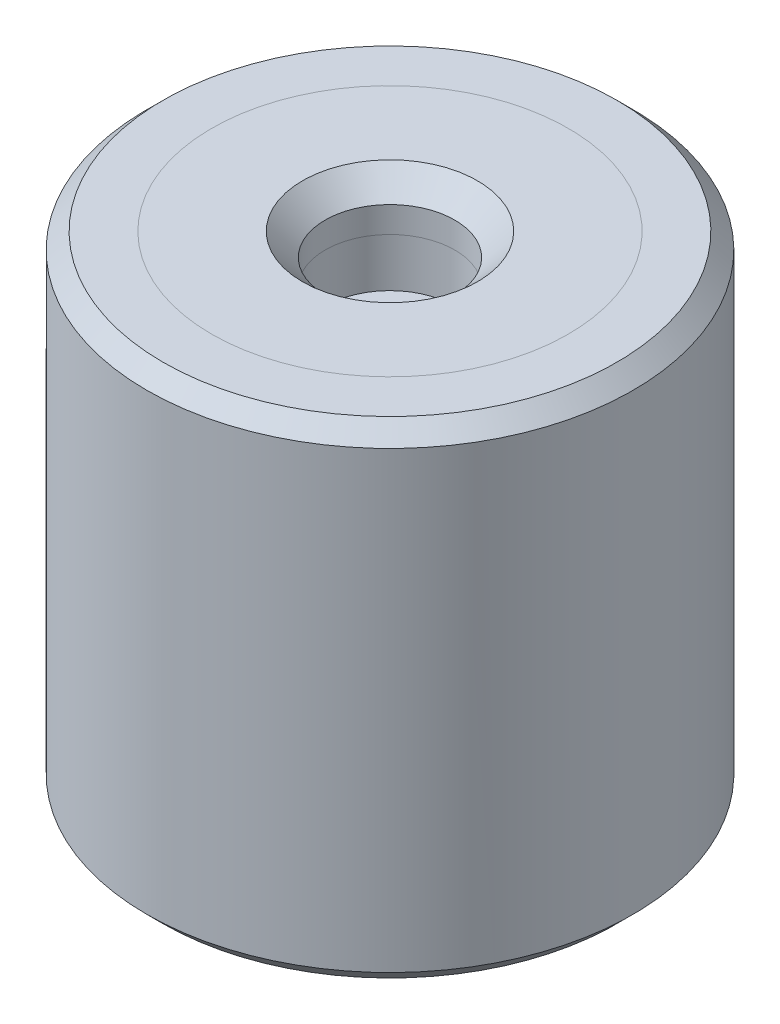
ISO-10303-21;
HEADER;
FILE_DESCRIPTION(('STEP AP214'),'2;1');
FILE_NAME('part.step','',(''),(''),'','','');
FILE_SCHEMA(('AUTOMOTIVE_DESIGN { 1 0 10303 214 1 1 1 1 }'));
ENDSEC;
DATA;
#1=APPLICATION_CONTEXT('core data for automotive mechanical design processes');
#2=APPLICATION_PROTOCOL_DEFINITION('international standard','automotive_design',2000,#1);
#3=PRODUCT_CONTEXT('',#1,'mechanical');
#4=PRODUCT('Part','Part','',(#3));
#5=PRODUCT_RELATED_PRODUCT_CATEGORY('part','',(#4));
#6=PRODUCT_DEFINITION_FORMATION('','',#4);
#7=PRODUCT_DEFINITION_CONTEXT('part definition',#1,'design');
#8=PRODUCT_DEFINITION('design','',#6,#7);
#9=PRODUCT_DEFINITION_SHAPE('','',#8);
#10=(LENGTH_UNIT() NAMED_UNIT(*) SI_UNIT(.MILLI.,.METRE.));
#11=(NAMED_UNIT(*) PLANE_ANGLE_UNIT() SI_UNIT($,.RADIAN.));
#12=(NAMED_UNIT(*) SI_UNIT($,.STERADIAN.) SOLID_ANGLE_UNIT());
#13=UNCERTAINTY_MEASURE_WITH_UNIT(LENGTH_MEASURE(1.E-05),#10,'distance_accuracy_value','');
#14=(GEOMETRIC_REPRESENTATION_CONTEXT(3) GLOBAL_UNCERTAINTY_ASSIGNED_CONTEXT((#13)) GLOBAL_UNIT_ASSIGNED_CONTEXT((#10,
#11,#12)) REPRESENTATION_CONTEXT('',''));
#15=CARTESIAN_POINT('',(0.,0.,0.));
#16=DIRECTION('',(0.,0.,1.));
#17=DIRECTION('',(1.,0.,0.));
#18=AXIS2_PLACEMENT_3D('',#15,#16,#17);
#19=CARTESIAN_POINT('',(0.,56.0340428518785,0.));
#20=DIRECTION('',(0.,1.,0.));
#21=DIRECTION('',(0.,0.,1.));
#22=AXIS2_PLACEMENT_3D('',#19,#20,#21);
#23=CYLINDRICAL_SURFACE('',#22,2.);
#24=CARTESIAN_POINT('',(0.,-12.8,0.));
#25=DIRECTION('',(0.,-1.,0.));
#26=DIRECTION('',(0.,0.,-1.));
#27=AXIS2_PLACEMENT_3D('',#24,#25,#26);
#28=CIRCLE('',#27,2.);
#29=CARTESIAN_POINT('',(0.,-12.8,-2.));
#30=VERTEX_POINT('',#29);
#31=EDGE_CURVE('P0_E10',#30,#30,#28,.T.);
#32=ORIENTED_EDGE('',*,*,#31,.T.);
#33=EDGE_LOOP('',(#32));
#34=FACE_BOUND('',#33,.T.);
#35=CARTESIAN_POINT('',(0.,-12.,0.));
#36=DIRECTION('',(0.,1.,0.));
#37=DIRECTION('',(0.,0.,1.));
#38=AXIS2_PLACEMENT_3D('',#35,#36,#37);
#39=CIRCLE('',#38,2.);
#40=CARTESIAN_POINT('',(0.,-12.,2.));
#41=VERTEX_POINT('',#40);
#42=EDGE_CURVE('P0_E25',#41,#41,#39,.T.);
#43=ORIENTED_EDGE('',*,*,#42,.T.);
#44=EDGE_LOOP('',(#43));
#45=FACE_BOUND('',#44,.T.);
#46=ADVANCED_FACE('P0_F14',(#34,#45),#23,.F.);
#47=CARTESIAN_POINT('',(0.,-12.,2.));
#48=DIRECTION('',(0.,1.,0.));
#49=DIRECTION('',(0.,0.,1.));
#50=AXIS2_PLACEMENT_3D('',#47,#48,#49);
#51=PLANE('',#50);
#52=CARTESIAN_POINT('',(0.,-12.,0.));
#53=DIRECTION('',(0.,1.,0.));
#54=DIRECTION('',(0.,0.,1.));
#55=AXIS2_PLACEMENT_3D('',#52,#53,#54);
#56=CIRCLE('',#55,5.5);
#57=CARTESIAN_POINT('',(0.,-12.,5.5));
#58=VERTEX_POINT('',#57);
#59=EDGE_CURVE('P0_E29',#58,#58,#56,.T.);
#60=ORIENTED_EDGE('',*,*,#59,.T.);
#61=EDGE_LOOP('',(#60));
#62=FACE_BOUND('',#61,.T.);
#63=ORIENTED_EDGE('',*,*,#42,.F.);
#64=EDGE_LOOP('',(#63));
#65=FACE_BOUND('',#64,.T.);
#66=ADVANCED_FACE('P0_F50',(#62,#65),#51,.T.);
#67=CARTESIAN_POINT('',(0.,56.0340428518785,0.));
#68=DIRECTION('',(0.,1.,0.));
#69=DIRECTION('',(0.,0.,1.));
#70=AXIS2_PLACEMENT_3D('',#67,#68,#69);
#71=CYLINDRICAL_SURFACE('',#70,5.5);
#72=CARTESIAN_POINT('',(0.,-13.5,0.));
#73=DIRECTION('',(0.,1.,0.));
#74=DIRECTION('',(0.,0.,1.));
#75=AXIS2_PLACEMENT_3D('',#72,#73,#74);
#76=CIRCLE('',#75,5.5);
#77=CARTESIAN_POINT('',(0.,-13.5,5.5));
#78=VERTEX_POINT('',#77);
#79=EDGE_CURVE('P0_E34',#78,#78,#76,.T.);
#80=ORIENTED_EDGE('',*,*,#79,.T.);
#81=EDGE_LOOP('',(#80));
#82=FACE_BOUND('',#81,.T.);
#83=ORIENTED_EDGE('',*,*,#59,.F.);
#84=EDGE_LOOP('',(#83));
#85=FACE_BOUND('',#84,.T.);
#86=ADVANCED_FACE('P0_F38',(#82,#85),#71,.T.);
#87=CARTESIAN_POINT('',(0.,-13.5,5.5));
#88=DIRECTION('',(0.,-1.,0.));
#89=DIRECTION('',(0.,0.,-1.));
#90=AXIS2_PLACEMENT_3D('',#87,#88,#89);
#91=PLANE('',#90);
#92=CARTESIAN_POINT('',(0.,-13.5,0.));
#93=DIRECTION('',(0.,-1.,0.));
#94=DIRECTION('',(0.,0.,-1.));
#95=AXIS2_PLACEMENT_3D('',#92,#93,#94);
#96=CIRCLE('',#95,2.7);
#97=CARTESIAN_POINT('',(0.,-13.5,-2.7));
#98=VERTEX_POINT('',#97);
#99=EDGE_CURVE('P0_E21',#98,#98,#96,.F.);
#100=ORIENTED_EDGE('',*,*,#99,.T.);
#101=EDGE_LOOP('',(#100));
#102=FACE_BOUND('',#101,.T.);
#103=ORIENTED_EDGE('',*,*,#79,.F.);
#104=EDGE_LOOP('',(#103));
#105=FACE_BOUND('',#104,.T.);
#106=ADVANCED_FACE('P0_F41',(#102,#105),#91,.T.);
#107=CARTESIAN_POINT('',(0.,-13.5,0.));
#108=DIRECTION('',(0.,-1.,0.));
#109=DIRECTION('',(0.,0.,-1.));
#110=AXIS2_PLACEMENT_3D('',#107,#108,#109);
#111=CONICAL_SURFACE('',#110,2.7,0.785398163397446);
#112=ORIENTED_EDGE('',*,*,#31,.F.);
#113=EDGE_LOOP('',(#112));
#114=FACE_BOUND('',#113,.T.);
#115=ORIENTED_EDGE('',*,*,#99,.F.);
#116=EDGE_LOOP('',(#115));
#117=FACE_BOUND('',#116,.T.);
#118=ADVANCED_FACE('P0_F16',(#114,#117),#111,.F.);
#119=CLOSED_SHELL('',(#46,#66,#86,#106,#118));
#120=MANIFOLD_SOLID_BREP('P0_B1',#119);
#121=CARTESIAN_POINT('',(0.,69.5340428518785,0.));
#122=DIRECTION('',(0.,1.,0.));
#123=DIRECTION('',(0.,0.,1.));
#124=AXIS2_PLACEMENT_3D('',#121,#122,#123);
#125=CYLINDRICAL_SURFACE('',#124,2.);
#126=CARTESIAN_POINT('',(0.,0.800000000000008,0.));
#127=DIRECTION('',(0.,1.,0.));
#128=DIRECTION('',(0.,0.,1.));
#129=AXIS2_PLACEMENT_3D('',#126,#127,#128);
#130=CIRCLE('',#129,2.);
#131=CARTESIAN_POINT('',(0.,0.800000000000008,2.));
#132=VERTEX_POINT('',#131);
#133=EDGE_CURVE('P1_E21',#132,#132,#130,.T.);
#134=ORIENTED_EDGE('',*,*,#133,.T.);
#135=EDGE_LOOP('',(#134));
#136=FACE_BOUND('',#135,.T.);
#137=CARTESIAN_POINT('',(0.,0.,0.));
#138=DIRECTION('',(0.,1.,0.));
#139=DIRECTION('',(0.,0.,1.));
#140=AXIS2_PLACEMENT_3D('',#137,#138,#139);
#141=CIRCLE('',#140,2.);
#142=CARTESIAN_POINT('',(0.,0.,2.));
#143=VERTEX_POINT('',#142);
#144=EDGE_CURVE('P1_E34',#143,#143,#141,.T.);
#145=ORIENTED_EDGE('',*,*,#144,.F.);
#146=EDGE_LOOP('',(#145));
#147=FACE_BOUND('',#146,.T.);
#148=ADVANCED_FACE('P1_F14',(#136,#147),#125,.F.);
#149=CARTESIAN_POINT('',(0.,1.5,2.));
#150=DIRECTION('',(0.,1.,0.));
#151=DIRECTION('',(0.,0.,1.));
#152=AXIS2_PLACEMENT_3D('',#149,#150,#151);
#153=PLANE('',#152);
#154=CARTESIAN_POINT('',(0.,1.5,0.));
#155=DIRECTION('',(0.,1.,0.));
#156=DIRECTION('',(0.,0.,1.));
#157=AXIS2_PLACEMENT_3D('',#154,#155,#156);
#158=CIRCLE('',#157,2.7);
#159=CARTESIAN_POINT('',(0.,1.5,2.7));
#160=VERTEX_POINT('',#159);
#161=EDGE_CURVE('P1_E10',#160,#160,#158,.F.);
#162=ORIENTED_EDGE('',*,*,#161,.T.);
#163=EDGE_LOOP('',(#162));
#164=FACE_BOUND('',#163,.T.);
#165=CARTESIAN_POINT('',(0.,1.5,0.));
#166=DIRECTION('',(0.,1.,0.));
#167=DIRECTION('',(0.,0.,1.));
#168=AXIS2_PLACEMENT_3D('',#165,#166,#167);
#169=CIRCLE('',#168,5.5);
#170=CARTESIAN_POINT('',(0.,1.5,5.5));
#171=VERTEX_POINT('',#170);
#172=EDGE_CURVE('P1_E25',#171,#171,#169,.T.);
#173=ORIENTED_EDGE('',*,*,#172,.T.);
#174=EDGE_LOOP('',(#173));
#175=FACE_BOUND('',#174,.T.);
#176=ADVANCED_FACE('P1_F42',(#164,#175),#153,.T.);
#177=CARTESIAN_POINT('',(0.,69.5340428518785,0.));
#178=DIRECTION('',(0.,1.,0.));
#179=DIRECTION('',(0.,0.,1.));
#180=AXIS2_PLACEMENT_3D('',#177,#178,#179);
#181=CYLINDRICAL_SURFACE('',#180,5.5);
#182=CARTESIAN_POINT('',(0.,0.,0.));
#183=DIRECTION('',(0.,1.,0.));
#184=DIRECTION('',(0.,0.,1.));
#185=AXIS2_PLACEMENT_3D('',#182,#183,#184);
#186=CIRCLE('',#185,5.5);
#187=CARTESIAN_POINT('',(0.,0.,5.5));
#188=VERTEX_POINT('',#187);
#189=EDGE_CURVE('P1_E29',#188,#188,#186,.T.);
#190=ORIENTED_EDGE('',*,*,#189,.T.);
#191=EDGE_LOOP('',(#190));
#192=FACE_BOUND('',#191,.T.);
#193=ORIENTED_EDGE('',*,*,#172,.F.);
#194=EDGE_LOOP('',(#193));
#195=FACE_BOUND('',#194,.T.);
#196=ADVANCED_FACE('P1_F47',(#192,#195),#181,.T.);
#197=CARTESIAN_POINT('',(0.,0.,5.5));
#198=DIRECTION('',(0.,-1.,0.));
#199=DIRECTION('',(0.,0.,-1.));
#200=AXIS2_PLACEMENT_3D('',#197,#198,#199);
#201=PLANE('',#200);
#202=ORIENTED_EDGE('',*,*,#144,.T.);
#203=EDGE_LOOP('',(#202));
#204=FACE_BOUND('',#203,.T.);
#205=ORIENTED_EDGE('',*,*,#189,.F.);
#206=EDGE_LOOP('',(#205));
#207=FACE_BOUND('',#206,.T.);
#208=ADVANCED_FACE('P1_F38',(#204,#207),#201,.T.);
#209=CARTESIAN_POINT('',(0.,0.800000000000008,0.));
#210=DIRECTION('',(0.,1.,0.));
#211=DIRECTION('',(0.,0.,1.));
#212=AXIS2_PLACEMENT_3D('',#209,#210,#211);
#213=CONICAL_SURFACE('',#212,2.,0.785398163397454);
#214=ORIENTED_EDGE('',*,*,#161,.F.);
#215=EDGE_LOOP('',(#214));
#216=FACE_BOUND('',#215,.T.);
#217=ORIENTED_EDGE('',*,*,#133,.F.);
#218=EDGE_LOOP('',(#217));
#219=FACE_BOUND('',#218,.T.);
#220=ADVANCED_FACE('P1_F16',(#216,#219),#213,.F.);
#221=CLOSED_SHELL('',(#148,#176,#196,#208,#220));
#222=MANIFOLD_SOLID_BREP('P1_B1',#221);
#223=CARTESIAN_POINT('',(0.,0.,0.));
#224=DIRECTION('',(0.,1.,0.));
#225=DIRECTION('',(0.,0.,1.));
#226=AXIS2_PLACEMENT_3D('',#223,#224,#225);
#227=PLANE('',#226);
#228=CARTESIAN_POINT('',(0.,0.,0.));
#229=DIRECTION('',(0.,1.,0.));
#230=DIRECTION('',(0.,0.,1.));
#231=AXIS2_PLACEMENT_3D('',#228,#229,#230);
#232=CIRCLE('',#231,2.);
#233=CARTESIAN_POINT('',(0.,0.,2.));
#234=VERTEX_POINT('',#233);
#235=EDGE_CURVE('P2_E46',#234,#234,#232,.T.);
#236=ORIENTED_EDGE('',*,*,#235,.F.);
#237=EDGE_LOOP('',(#236));
#238=FACE_BOUND('',#237,.T.);
#239=CARTESIAN_POINT('',(0.,0.,0.));
#240=DIRECTION('',(0.,1.,0.));
#241=DIRECTION('',(0.,0.,1.));
#242=AXIS2_PLACEMENT_3D('',#239,#240,#241);
#243=CIRCLE('',#242,5.5);
#244=CARTESIAN_POINT('',(0.,0.,5.5));
#245=VERTEX_POINT('',#244);
#246=EDGE_CURVE('P2_E33',#245,#245,#243,.T.);
#247=ORIENTED_EDGE('',*,*,#246,.T.);
#248=EDGE_LOOP('',(#247));
#249=FACE_BOUND('',#248,.T.);
#250=ADVANCED_FACE('P2_F13',(#238,#249),#227,.T.);
#251=CARTESIAN_POINT('',(0.,65.5134936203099,0.));
#252=DIRECTION('',(0.,1.,0.));
#253=DIRECTION('',(0.,0.,1.));
#254=AXIS2_PLACEMENT_3D('',#251,#252,#253);
#255=CYLINDRICAL_SURFACE('',#254,5.5);
#256=CARTESIAN_POINT('',(0.,1.5,0.));
#257=DIRECTION('',(0.,1.,0.));
#258=DIRECTION('',(0.,0.,1.));
#259=AXIS2_PLACEMENT_3D('',#256,#257,#258);
#260=CIRCLE('',#259,5.5);
#261=CARTESIAN_POINT('',(0.,1.5,5.5));
#262=VERTEX_POINT('',#261);
#263=EDGE_CURVE('P2_E36',#262,#262,#260,.T.);
#264=ORIENTED_EDGE('',*,*,#263,.T.);
#265=EDGE_LOOP('',(#264));
#266=FACE_BOUND('',#265,.T.);
#267=ORIENTED_EDGE('',*,*,#246,.F.);
#268=EDGE_LOOP('',(#267));
#269=FACE_BOUND('',#268,.T.);
#270=ADVANCED_FACE('P2_F92',(#266,#269),#255,.F.);
#271=CARTESIAN_POINT('',(0.,1.5,5.5));
#272=DIRECTION('',(0.,1.,0.));
#273=DIRECTION('',(0.,0.,1.));
#274=AXIS2_PLACEMENT_3D('',#271,#272,#273);
#275=PLANE('',#274);
#276=CARTESIAN_POINT('',(0.,1.5,0.));
#277=DIRECTION('',(0.,1.,0.));
#278=DIRECTION('',(0.,0.,1.));
#279=AXIS2_PLACEMENT_3D('',#276,#277,#278);
#280=CIRCLE('',#279,7.);
#281=CARTESIAN_POINT('',(0.,1.5,7.));
#282=VERTEX_POINT('',#281);
#283=EDGE_CURVE('P2_E9',#282,#282,#280,.T.);
#284=ORIENTED_EDGE('',*,*,#283,.T.);
#285=EDGE_LOOP('',(#284));
#286=FACE_BOUND('',#285,.T.);
#287=ORIENTED_EDGE('',*,*,#263,.F.);
#288=EDGE_LOOP('',(#287));
#289=FACE_BOUND('',#288,.T.);
#290=ADVANCED_FACE('P2_F88',(#286,#289),#275,.T.);
#291=CARTESIAN_POINT('',(0.,65.5134936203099,0.));
#292=DIRECTION('',(0.,1.,0.));
#293=DIRECTION('',(0.,0.,1.));
#294=AXIS2_PLACEMENT_3D('',#291,#292,#293);
#295=CYLINDRICAL_SURFACE('',#294,7.5);
#296=CARTESIAN_POINT('',(0.,-13.,0.));
#297=DIRECTION('',(0.,-1.,0.));
#298=DIRECTION('',(0.,0.,-1.));
#299=AXIS2_PLACEMENT_3D('',#296,#297,#298);
#300=CIRCLE('',#299,7.5);
#301=CARTESIAN_POINT('',(0.,-13.,-7.5));
#302=VERTEX_POINT('',#301);
#303=EDGE_CURVE('P2_E24',#302,#302,#300,.F.);
#304=ORIENTED_EDGE('',*,*,#303,.T.);
#305=EDGE_LOOP('',(#304));
#306=FACE_BOUND('',#305,.T.);
#307=CARTESIAN_POINT('',(0.,0.999999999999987,0.));
#308=DIRECTION('',(0.,1.,0.));
#309=DIRECTION('',(0.,0.,1.));
#310=AXIS2_PLACEMENT_3D('',#307,#308,#309);
#311=CIRCLE('',#310,7.5);
#312=CARTESIAN_POINT('',(0.,0.999999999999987,7.5));
#313=VERTEX_POINT('',#312);
#314=EDGE_CURVE('P2_E28',#313,#313,#311,.F.);
#315=ORIENTED_EDGE('',*,*,#314,.T.);
#316=EDGE_LOOP('',(#315));
#317=FACE_BOUND('',#316,.T.);
#318=ADVANCED_FACE('P2_F82',(#306,#317),#295,.T.);
#319=CARTESIAN_POINT('',(0.,-13.5,7.5));
#320=DIRECTION('',(0.,-1.,0.));
#321=DIRECTION('',(0.,0.,-1.));
#322=AXIS2_PLACEMENT_3D('',#319,#320,#321);
#323=PLANE('',#322);
#324=CARTESIAN_POINT('',(0.,-13.5,0.));
#325=DIRECTION('',(0.,-1.,0.));
#326=DIRECTION('',(0.,0.,-1.));
#327=AXIS2_PLACEMENT_3D('',#324,#325,#326);
#328=CIRCLE('',#327,7.);
#329=CARTESIAN_POINT('',(0.,-13.5,-7.));
#330=VERTEX_POINT('',#329);
#331=EDGE_CURVE('P2_E20',#330,#330,#328,.T.);
#332=ORIENTED_EDGE('',*,*,#331,.T.);
#333=EDGE_LOOP('',(#332));
#334=FACE_BOUND('',#333,.T.);
#335=CARTESIAN_POINT('',(0.,-13.5,0.));
#336=DIRECTION('',(0.,1.,0.));
#337=DIRECTION('',(0.,0.,1.));
#338=AXIS2_PLACEMENT_3D('',#335,#336,#337);
#339=CIRCLE('',#338,5.49999999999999);
#340=CARTESIAN_POINT('',(0.,-13.5,5.49999999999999));
#341=VERTEX_POINT('',#340);
#342=EDGE_CURVE('P2_E39',#341,#341,#339,.T.);
#343=ORIENTED_EDGE('',*,*,#342,.T.);
#344=EDGE_LOOP('',(#343));
#345=FACE_BOUND('',#344,.T.);
#346=ADVANCED_FACE('P2_F77',(#334,#345),#323,.T.);
#347=CARTESIAN_POINT('',(0.,65.5134936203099,0.));
#348=DIRECTION('',(0.,1.,0.));
#349=DIRECTION('',(0.,0.,1.));
#350=AXIS2_PLACEMENT_3D('',#347,#348,#349);
#351=CYLINDRICAL_SURFACE('',#350,5.49999999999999);
#352=CARTESIAN_POINT('',(0.,-12.,0.));
#353=DIRECTION('',(0.,1.,0.));
#354=DIRECTION('',(0.,0.,1.));
#355=AXIS2_PLACEMENT_3D('',#352,#353,#354);
#356=CIRCLE('',#355,5.49999999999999);
#357=CARTESIAN_POINT('',(0.,-12.,5.49999999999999));
#358=VERTEX_POINT('',#357);
#359=EDGE_CURVE('P2_E42',#358,#358,#356,.T.);
#360=ORIENTED_EDGE('',*,*,#359,.T.);
#361=EDGE_LOOP('',(#360));
#362=FACE_BOUND('',#361,.T.);
#363=ORIENTED_EDGE('',*,*,#342,.F.);
#364=EDGE_LOOP('',(#363));
#365=FACE_BOUND('',#364,.T.);
#366=ADVANCED_FACE('P2_F71',(#362,#365),#351,.F.);
#367=CARTESIAN_POINT('',(0.,-12.,5.49999999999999));
#368=DIRECTION('',(0.,-1.,0.));
#369=DIRECTION('',(0.,0.,-1.));
#370=AXIS2_PLACEMENT_3D('',#367,#368,#369);
#371=PLANE('',#370);
#372=CARTESIAN_POINT('',(0.,-12.,0.));
#373=DIRECTION('',(0.,-1.,0.));
#374=DIRECTION('',(0.,0.,-1.));
#375=AXIS2_PLACEMENT_3D('',#372,#373,#374);
#376=CIRCLE('',#375,2.);
#377=CARTESIAN_POINT('',(0.,-12.,-2.));
#378=VERTEX_POINT('',#377);
#379=EDGE_CURVE('P2_E52',#378,#378,#376,.T.);
#380=ORIENTED_EDGE('',*,*,#379,.F.);
#381=EDGE_LOOP('',(#380));
#382=FACE_BOUND('',#381,.T.);
#383=ORIENTED_EDGE('',*,*,#359,.F.);
#384=EDGE_LOOP('',(#383));
#385=FACE_BOUND('',#384,.T.);
#386=ADVANCED_FACE('P2_F67',(#382,#385),#371,.T.);
#387=CARTESIAN_POINT('',(0.,-13.,0.));
#388=DIRECTION('',(0.,1.,0.));
#389=DIRECTION('',(0.,0.,1.));
#390=AXIS2_PLACEMENT_3D('',#387,#388,#389);
#391=CONICAL_SURFACE('',#390,7.5,0.785398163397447);
#392=ORIENTED_EDGE('',*,*,#331,.F.);
#393=EDGE_LOOP('',(#392));
#394=FACE_BOUND('',#393,.T.);
#395=ORIENTED_EDGE('',*,*,#303,.F.);
#396=EDGE_LOOP('',(#395));
#397=FACE_BOUND('',#396,.T.);
#398=ADVANCED_FACE('P2_F70',(#394,#397),#391,.T.);
#399=CARTESIAN_POINT('',(0.,1.5,0.));
#400=DIRECTION('',(0.,-1.,0.));
#401=DIRECTION('',(0.,0.,-1.));
#402=AXIS2_PLACEMENT_3D('',#399,#400,#401);
#403=CONICAL_SURFACE('',#402,7.,0.785398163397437);
#404=ORIENTED_EDGE('',*,*,#314,.F.);
#405=EDGE_LOOP('',(#404));
#406=FACE_BOUND('',#405,.T.);
#407=ORIENTED_EDGE('',*,*,#283,.F.);
#408=EDGE_LOOP('',(#407));
#409=FACE_BOUND('',#408,.T.);
#410=ADVANCED_FACE('P2_F15',(#406,#409),#403,.T.);
#411=CARTESIAN_POINT('',(0.,-1.5,0.));
#412=DIRECTION('',(0.,1.,0.));
#413=DIRECTION('',(0.,0.,1.));
#414=AXIS2_PLACEMENT_3D('',#411,#412,#413);
#415=CYLINDRICAL_SURFACE('',#414,2.);
#416=CARTESIAN_POINT('',(0.,-1.5,0.));
#417=DIRECTION('',(0.,1.,0.));
#418=DIRECTION('',(0.,0.,1.));
#419=AXIS2_PLACEMENT_3D('',#416,#417,#418);
#420=CIRCLE('',#419,2.);
#421=CARTESIAN_POINT('',(0.,-1.5,2.));
#422=VERTEX_POINT('',#421);
#423=EDGE_CURVE('P2_E45',#422,#422,#420,.T.);
#424=ORIENTED_EDGE('',*,*,#423,.F.);
#425=EDGE_LOOP('',(#424));
#426=FACE_BOUND('',#425,.T.);
#427=ORIENTED_EDGE('',*,*,#235,.T.);
#428=EDGE_LOOP('',(#427));
#429=FACE_BOUND('',#428,.T.);
#430=ADVANCED_FACE('P2_F108',(#426,#429),#415,.F.);
#431=CARTESIAN_POINT('',(0.,-1.5,0.));
#432=DIRECTION('',(0.,1.,0.));
#433=DIRECTION('',(0.,0.,1.));
#434=AXIS2_PLACEMENT_3D('',#431,#432,#433);
#435=PLANE('',#434);
#436=ORIENTED_EDGE('',*,*,#423,.T.);
#437=EDGE_LOOP('',(#436));
#438=FACE_BOUND('',#437,.T.);
#439=ADVANCED_FACE('P2_F63',(#438),#435,.T.);
#440=CARTESIAN_POINT('',(0.,-10.5,0.));
#441=DIRECTION('',(0.,-1.,0.));
#442=DIRECTION('',(0.,0.,-1.));
#443=AXIS2_PLACEMENT_3D('',#440,#441,#442);
#444=CYLINDRICAL_SURFACE('',#443,2.);
#445=CARTESIAN_POINT('',(0.,-10.5,0.));
#446=DIRECTION('',(0.,-1.,0.));
#447=DIRECTION('',(0.,0.,-1.));
#448=AXIS2_PLACEMENT_3D('',#445,#446,#447);
#449=CIRCLE('',#448,2.);
#450=CARTESIAN_POINT('',(0.,-10.5,-2.));
#451=VERTEX_POINT('',#450);
#452=EDGE_CURVE('P2_E49',#451,#451,#449,.T.);
#453=ORIENTED_EDGE('',*,*,#452,.F.);
#454=EDGE_LOOP('',(#453));
#455=FACE_BOUND('',#454,.T.);
#456=ORIENTED_EDGE('',*,*,#379,.T.);
#457=EDGE_LOOP('',(#456));
#458=FACE_BOUND('',#457,.T.);
#459=ADVANCED_FACE('P2_F60',(#455,#458),#444,.F.);
#460=CARTESIAN_POINT('',(0.,-10.5,0.));
#461=DIRECTION('',(0.,-1.,0.));
#462=DIRECTION('',(0.,0.,-1.));
#463=AXIS2_PLACEMENT_3D('',#460,#461,#462);
#464=PLANE('',#463);
#465=ORIENTED_EDGE('',*,*,#452,.T.);
#466=EDGE_LOOP('',(#465));
#467=FACE_BOUND('',#466,.T.);
#468=ADVANCED_FACE('P2_F58',(#467),#464,.T.);
#469=CLOSED_SHELL('',(#250,#270,#290,#318,#346,#366,#386,#398,#410,#430,#439,#459,#468));
#470=MANIFOLD_SOLID_BREP('P2_B1',#469);
#471=ADVANCED_BREP_SHAPE_REPRESENTATION('',(#18,#120,#222,#470),#14);
#472=SHAPE_DEFINITION_REPRESENTATION(#9,#471);
ENDSEC;
END-ISO-10303-21;
